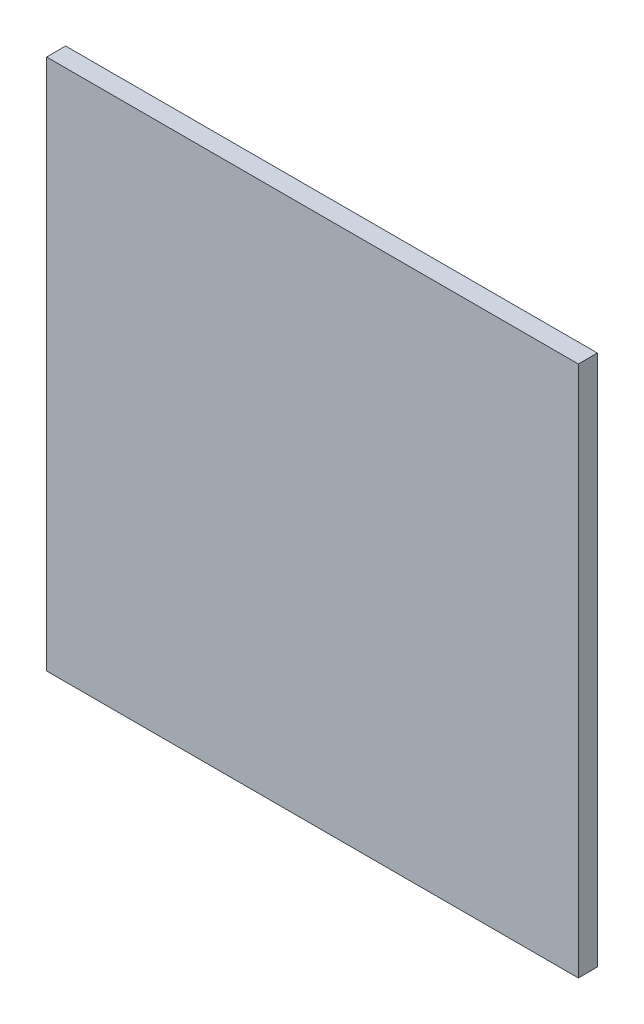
from build123d import *

# Parameters (mm, degrees)
SKETCH1_W           = 279.4
SKETCH1_H           = 279.4
BOSS_EXTRUDE1_DEPTH = 10


with BuildPart() as part:
    # Sketch1 → Boss-Extrude1 (new body)
    with BuildSketch(Plane.XY):
        Rectangle(SKETCH1_W, SKETCH1_H)
    extrude(amount=BOSS_EXTRUDE1_DEPTH)


solid = part.part
